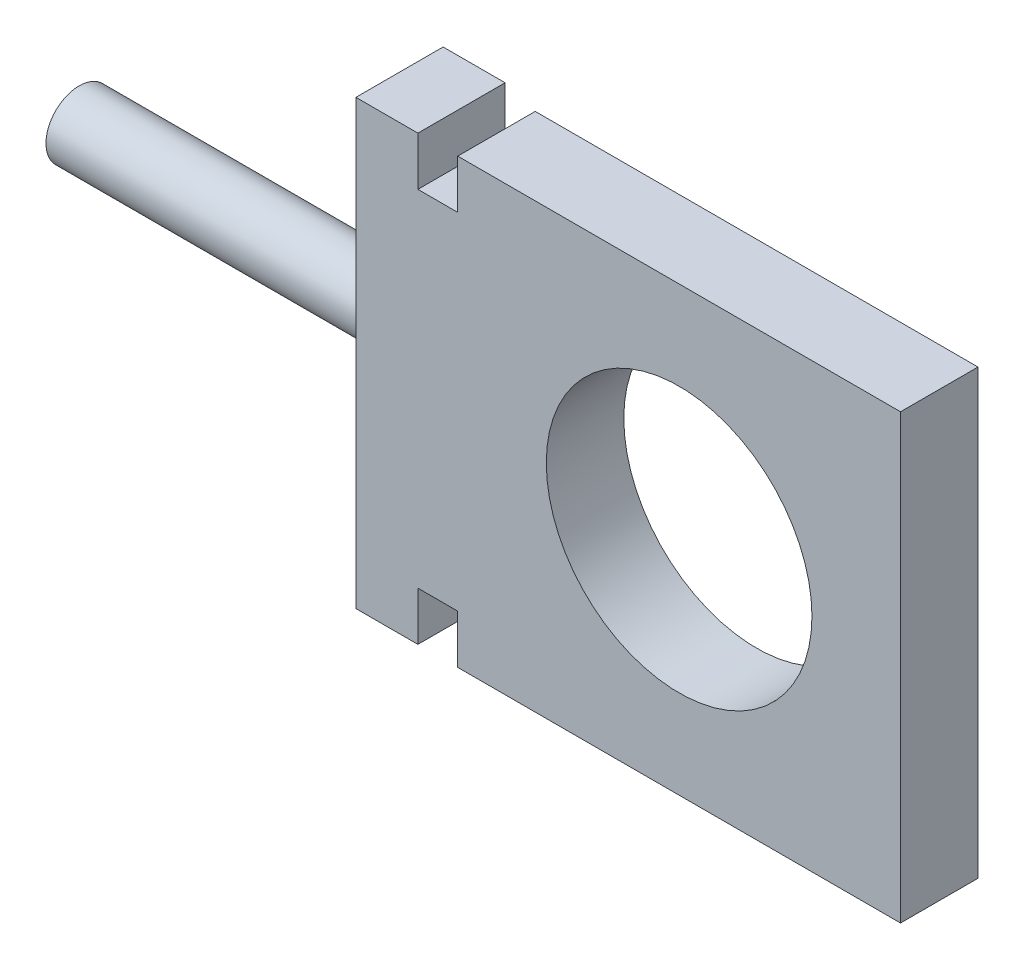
ISO-10303-21;
HEADER;
FILE_DESCRIPTION(('STEP AP214'),'2;1');
FILE_NAME('part.step','',(''),(''),'','','');
FILE_SCHEMA(('AUTOMOTIVE_DESIGN { 1 0 10303 214 1 1 1 1 }'));
ENDSEC;
DATA;
#1=APPLICATION_CONTEXT('core data for automotive mechanical design processes');
#2=APPLICATION_PROTOCOL_DEFINITION('international standard','automotive_design',2000,#1);
#3=PRODUCT_CONTEXT('',#1,'mechanical');
#4=PRODUCT('Part','Part','',(#3));
#5=PRODUCT_RELATED_PRODUCT_CATEGORY('part','',(#4));
#6=PRODUCT_DEFINITION_FORMATION('','',#4);
#7=PRODUCT_DEFINITION_CONTEXT('part definition',#1,'design');
#8=PRODUCT_DEFINITION('design','',#6,#7);
#9=PRODUCT_DEFINITION_SHAPE('','',#8);
#10=(LENGTH_UNIT() NAMED_UNIT(*) SI_UNIT(.MILLI.,.METRE.));
#11=(NAMED_UNIT(*) PLANE_ANGLE_UNIT() SI_UNIT($,.RADIAN.));
#12=(NAMED_UNIT(*) SI_UNIT($,.STERADIAN.) SOLID_ANGLE_UNIT());
#13=UNCERTAINTY_MEASURE_WITH_UNIT(LENGTH_MEASURE(1.E-05),#10,'distance_accuracy_value','');
#14=(GEOMETRIC_REPRESENTATION_CONTEXT(3) GLOBAL_UNCERTAINTY_ASSIGNED_CONTEXT((#13)) GLOBAL_UNIT_ASSIGNED_CONTEXT((#10,
#11,#12)) REPRESENTATION_CONTEXT('',''));
#15=CARTESIAN_POINT('',(0.,0.,0.));
#16=DIRECTION('',(0.,0.,1.));
#17=DIRECTION('',(1.,0.,0.));
#18=AXIS2_PLACEMENT_3D('',#15,#16,#17);
#19=CARTESIAN_POINT('',(63.5,63.5,22.225));
#20=DIRECTION('',(-1.,0.,0.));
#21=DIRECTION('',(0.,-1.,0.));
#22=AXIS2_PLACEMENT_3D('',#19,#20,#21);
#23=PLANE('',#22);
#24=DIRECTION('',(0.,1.,0.));
#25=VECTOR('',#24,1.);
#26=CARTESIAN_POINT('',(63.5,63.5,0.));
#27=LINE('',#26,#25);
#28=CARTESIAN_POINT('',(63.5,-63.5,0.));
#29=VERTEX_POINT('',#28);
#30=CARTESIAN_POINT('',(63.5,63.5,0.));
#31=VERTEX_POINT('',#30);
#32=EDGE_CURVE('E254',#29,#31,#27,.T.);
#33=ORIENTED_EDGE('',*,*,#32,.T.);
#34=DIRECTION('',(0.,0.,-1.));
#35=VECTOR('',#34,1.);
#36=CARTESIAN_POINT('',(63.5,63.5,22.225));
#37=LINE('',#36,#35);
#38=CARTESIAN_POINT('',(63.5,63.5,22.225));
#39=VERTEX_POINT('',#38);
#40=EDGE_CURVE('E42',#39,#31,#37,.T.);
#41=ORIENTED_EDGE('',*,*,#40,.F.);
#42=DIRECTION('',(0.,1.,0.));
#43=VECTOR('',#42,1.);
#44=CARTESIAN_POINT('',(63.5,63.5,22.225));
#45=LINE('',#44,#43);
#46=CARTESIAN_POINT('',(63.5,-63.5,22.225));
#47=VERTEX_POINT('',#46);
#48=EDGE_CURVE('E257',#47,#39,#45,.T.);
#49=ORIENTED_EDGE('',*,*,#48,.F.);
#50=DIRECTION('',(0.,0.,-1.));
#51=VECTOR('',#50,1.);
#52=CARTESIAN_POINT('',(63.5,-63.5,22.225));
#53=LINE('',#52,#51);
#54=EDGE_CURVE('E276',#47,#29,#53,.T.);
#55=ORIENTED_EDGE('',*,*,#54,.T.);
#56=EDGE_LOOP('',(#33,#41,#49,#55));
#57=FACE_BOUND('',#56,.T.);
#58=ADVANCED_FACE('F33',(#57),#23,.F.);
#59=CARTESIAN_POINT('',(-63.5,63.5,22.225));
#60=DIRECTION('',(0.,-1.,0.));
#61=DIRECTION('',(0.,0.,-1.));
#62=AXIS2_PLACEMENT_3D('',#59,#60,#61);
#63=PLANE('',#62);
#64=DIRECTION('',(-1.,0.,0.));
#65=VECTOR('',#64,1.);
#66=CARTESIAN_POINT('',(-63.5,63.5,0.));
#67=LINE('',#66,#65);
#68=CARTESIAN_POINT('',(-63.5,63.5,0.));
#69=VERTEX_POINT('',#68);
#70=EDGE_CURVE('E282',#31,#69,#67,.T.);
#71=ORIENTED_EDGE('',*,*,#70,.T.);
#72=DIRECTION('',(0.,0.,-1.));
#73=VECTOR('',#72,1.);
#74=CARTESIAN_POINT('',(-63.5,63.5,22.225));
#75=LINE('',#74,#73);
#76=CARTESIAN_POINT('',(-63.5,63.5,22.225));
#77=VERTEX_POINT('',#76);
#78=EDGE_CURVE('E270',#77,#69,#75,.T.);
#79=ORIENTED_EDGE('',*,*,#78,.F.);
#80=DIRECTION('',(-1.,0.,0.));
#81=VECTOR('',#80,1.);
#82=CARTESIAN_POINT('',(-63.5,63.5,22.225));
#83=LINE('',#82,#81);
#84=EDGE_CURVE('E259',#39,#77,#83,.T.);
#85=ORIENTED_EDGE('',*,*,#84,.F.);
#86=ORIENTED_EDGE('',*,*,#40,.T.);
#87=EDGE_LOOP('',(#71,#79,#85,#86));
#88=FACE_BOUND('',#87,.T.);
#89=ADVANCED_FACE('F295',(#88),#63,.F.);
#90=CARTESIAN_POINT('',(-63.5,63.5,22.225));
#91=DIRECTION('',(1.,0.,0.));
#92=DIRECTION('',(0.,0.,-1.));
#93=AXIS2_PLACEMENT_3D('',#90,#91,#92);
#94=PLANE('',#93);
#95=DIRECTION('',(0.,-1.,0.));
#96=VECTOR('',#95,1.);
#97=CARTESIAN_POINT('',(-63.5,63.5,22.225));
#98=LINE('',#97,#96);
#99=CARTESIAN_POINT('',(-63.5,-49.53,22.225));
#100=VERTEX_POINT('',#99);
#101=CARTESIAN_POINT('',(-63.5,-63.5,22.225));
#102=VERTEX_POINT('',#101);
#103=EDGE_CURVE('E227',#100,#102,#98,.T.);
#104=ORIENTED_EDGE('',*,*,#103,.F.);
#105=DIRECTION('',(0.,0.,-1.));
#106=VECTOR('',#105,1.);
#107=CARTESIAN_POINT('',(-63.5,-49.53,22.225));
#108=LINE('',#107,#106);
#109=CARTESIAN_POINT('',(-63.5,-49.53,9.525));
#110=VERTEX_POINT('',#109);
#111=EDGE_CURVE('E179',#100,#110,#108,.T.);
#112=ORIENTED_EDGE('',*,*,#111,.T.);
#113=DIRECTION('',(0.,1.,0.));
#114=VECTOR('',#113,1.);
#115=CARTESIAN_POINT('',(-63.5,49.53,9.525));
#116=LINE('',#115,#114);
#117=CARTESIAN_POINT('',(-63.5,49.53,9.525));
#118=VERTEX_POINT('',#117);
#119=EDGE_CURVE('E220',#110,#118,#116,.T.);
#120=ORIENTED_EDGE('',*,*,#119,.T.);
#121=DIRECTION('',(0.,0.,1.));
#122=VECTOR('',#121,1.);
#123=CARTESIAN_POINT('',(-63.5,49.53,22.225));
#124=LINE('',#123,#122);
#125=CARTESIAN_POINT('',(-63.5,49.53,22.225));
#126=VERTEX_POINT('',#125);
#127=EDGE_CURVE('E209',#118,#126,#124,.T.);
#128=ORIENTED_EDGE('',*,*,#127,.T.);
#129=EDGE_CURVE('E266',#77,#126,#98,.T.);
#130=ORIENTED_EDGE('',*,*,#129,.F.);
#131=ORIENTED_EDGE('',*,*,#78,.T.);
#132=DIRECTION('',(0.,-1.,0.));
#133=VECTOR('',#132,1.);
#134=CARTESIAN_POINT('',(-63.5,63.5,0.));
#135=LINE('',#134,#133);
#136=CARTESIAN_POINT('',(-63.5,-63.5,0.));
#137=VERTEX_POINT('',#136);
#138=EDGE_CURVE('E280',#69,#137,#135,.T.);
#139=ORIENTED_EDGE('',*,*,#138,.T.);
#140=DIRECTION('',(0.,0.,-1.));
#141=VECTOR('',#140,1.);
#142=CARTESIAN_POINT('',(-63.5,-63.5,22.225));
#143=LINE('',#142,#141);
#144=EDGE_CURVE('E273',#102,#137,#143,.T.);
#145=ORIENTED_EDGE('',*,*,#144,.F.);
#146=EDGE_LOOP('',(#104,#112,#120,#128,#130,#131,#139,#145));
#147=FACE_BOUND('',#146,.T.);
#148=ADVANCED_FACE('F245',(#147),#94,.F.);
#149=CARTESIAN_POINT('',(-63.5,-63.5,22.225));
#150=DIRECTION('',(0.,1.,0.));
#151=DIRECTION('',(0.,0.,1.));
#152=AXIS2_PLACEMENT_3D('',#149,#150,#151);
#153=PLANE('',#152);
#154=DIRECTION('',(1.,0.,0.));
#155=VECTOR('',#154,1.);
#156=CARTESIAN_POINT('',(-63.5,-63.5,0.));
#157=LINE('',#156,#155);
#158=EDGE_CURVE('E260',#137,#29,#157,.T.);
#159=ORIENTED_EDGE('',*,*,#158,.T.);
#160=ORIENTED_EDGE('',*,*,#54,.F.);
#161=DIRECTION('',(1.,0.,0.));
#162=VECTOR('',#161,1.);
#163=CARTESIAN_POINT('',(-63.5,-63.5,22.225));
#164=LINE('',#163,#162);
#165=EDGE_CURVE('E263',#102,#47,#164,.T.);
#166=ORIENTED_EDGE('',*,*,#165,.F.);
#167=ORIENTED_EDGE('',*,*,#144,.T.);
#168=EDGE_LOOP('',(#159,#160,#166,#167));
#169=FACE_BOUND('',#168,.T.);
#170=ADVANCED_FACE('F299',(#169),#153,.F.);
#171=CARTESIAN_POINT('',(0.,0.,22.225));
#172=DIRECTION('',(0.,0.,1.));
#173=DIRECTION('',(1.,0.,0.));
#174=AXIS2_PLACEMENT_3D('',#171,#172,#173);
#175=PLANE('',#174);
#176=CARTESIAN_POINT('',(0.,0.,22.225));
#177=DIRECTION('',(0.,0.,1.));
#178=DIRECTION('',(1.,0.,0.));
#179=AXIS2_PLACEMENT_3D('',#176,#177,#178);
#180=CIRCLE('',#179,38.1);
#181=CARTESIAN_POINT('',(38.1,0.,22.225));
#182=VERTEX_POINT('',#181);
#183=EDGE_CURVE('E235',#182,#182,#180,.T.);
#184=ORIENTED_EDGE('',*,*,#183,.F.);
#185=EDGE_LOOP('',(#184));
#186=FACE_BOUND('',#185,.T.);
#187=ORIENTED_EDGE('',*,*,#48,.T.);
#188=ORIENTED_EDGE('',*,*,#84,.T.);
#189=ORIENTED_EDGE('',*,*,#129,.T.);
#190=DIRECTION('',(1.,0.,0.));
#191=VECTOR('',#190,1.);
#192=CARTESIAN_POINT('',(-74.93,49.53,22.225));
#193=LINE('',#192,#191);
#194=CARTESIAN_POINT('',(-74.93,49.53,22.225));
#195=VERTEX_POINT('',#194);
#196=EDGE_CURVE('E57',#195,#126,#193,.T.);
#197=ORIENTED_EDGE('',*,*,#196,.F.);
#198=DIRECTION('',(0.,1.,0.));
#199=VECTOR('',#198,1.);
#200=CARTESIAN_POINT('',(-74.93,-63.5,22.225));
#201=LINE('',#200,#199);
#202=CARTESIAN_POINT('',(-74.93,63.5,22.225));
#203=VERTEX_POINT('',#202);
#204=EDGE_CURVE('E164',#195,#203,#201,.T.);
#205=ORIENTED_EDGE('',*,*,#204,.T.);
#206=DIRECTION('',(1.,0.,0.));
#207=VECTOR('',#206,1.);
#208=CARTESIAN_POINT('',(-92.71,63.5,22.225));
#209=LINE('',#208,#207);
#210=CARTESIAN_POINT('',(-92.71,63.5,22.225));
#211=VERTEX_POINT('',#210);
#212=EDGE_CURVE('E180',#211,#203,#209,.T.);
#213=ORIENTED_EDGE('',*,*,#212,.F.);
#214=DIRECTION('',(0.,1.,0.));
#215=VECTOR('',#214,1.);
#216=CARTESIAN_POINT('',(-92.71,-63.5,22.225));
#217=LINE('',#216,#215);
#218=CARTESIAN_POINT('',(-92.71,-63.5,22.225));
#219=VERTEX_POINT('',#218);
#220=EDGE_CURVE('E158',#219,#211,#217,.T.);
#221=ORIENTED_EDGE('',*,*,#220,.F.);
#222=DIRECTION('',(1.,0.,0.));
#223=VECTOR('',#222,1.);
#224=CARTESIAN_POINT('',(-92.71,-63.5,22.225));
#225=LINE('',#224,#223);
#226=CARTESIAN_POINT('',(-74.93,-63.5,22.225));
#227=VERTEX_POINT('',#226);
#228=EDGE_CURVE('E176',#219,#227,#225,.T.);
#229=ORIENTED_EDGE('',*,*,#228,.T.);
#230=CARTESIAN_POINT('',(-74.93,-49.53,22.225));
#231=VERTEX_POINT('',#230);
#232=EDGE_CURVE('E173',#227,#231,#201,.T.);
#233=ORIENTED_EDGE('',*,*,#232,.T.);
#234=DIRECTION('',(1.,0.,0.));
#235=VECTOR('',#234,1.);
#236=CARTESIAN_POINT('',(-74.93,-49.53,22.225));
#237=LINE('',#236,#235);
#238=EDGE_CURVE('E231',#231,#100,#237,.T.);
#239=ORIENTED_EDGE('',*,*,#238,.T.);
#240=ORIENTED_EDGE('',*,*,#103,.T.);
#241=ORIENTED_EDGE('',*,*,#165,.T.);
#242=EDGE_LOOP('',(#187,#188,#189,#197,#205,#213,#221,#229,#233,#239,#240,#241));
#243=FACE_BOUND('',#242,.T.);
#244=ADVANCED_FACE('F200',(#186,#243),#175,.T.);
#245=CARTESIAN_POINT('',(0.,0.,0.));
#246=DIRECTION('',(0.,0.,1.));
#247=DIRECTION('',(1.,0.,0.));
#248=AXIS2_PLACEMENT_3D('',#245,#246,#247);
#249=PLANE('',#248);
#250=CARTESIAN_POINT('',(0.,0.,0.));
#251=DIRECTION('',(0.,0.,1.));
#252=DIRECTION('',(1.,0.,0.));
#253=AXIS2_PLACEMENT_3D('',#250,#251,#252);
#254=CIRCLE('',#253,38.1);
#255=CARTESIAN_POINT('',(38.1,0.,0.));
#256=VERTEX_POINT('',#255);
#257=EDGE_CURVE('E251',#256,#256,#254,.T.);
#258=ORIENTED_EDGE('',*,*,#257,.T.);
#259=EDGE_LOOP('',(#258));
#260=FACE_BOUND('',#259,.T.);
#261=ORIENTED_EDGE('',*,*,#32,.F.);
#262=ORIENTED_EDGE('',*,*,#158,.F.);
#263=ORIENTED_EDGE('',*,*,#138,.F.);
#264=ORIENTED_EDGE('',*,*,#70,.F.);
#265=EDGE_LOOP('',(#261,#262,#263,#264));
#266=FACE_BOUND('',#265,.T.);
#267=ADVANCED_FACE('F291',(#260,#266),#249,.F.);
#268=CARTESIAN_POINT('',(0.,0.,0.));
#269=DIRECTION('',(0.,0.,1.));
#270=DIRECTION('',(1.,0.,0.));
#271=AXIS2_PLACEMENT_3D('',#268,#269,#270);
#272=CYLINDRICAL_SURFACE('',#271,38.1);
#273=ORIENTED_EDGE('',*,*,#257,.F.);
#274=EDGE_LOOP('',(#273));
#275=FACE_BOUND('',#274,.T.);
#276=ORIENTED_EDGE('',*,*,#183,.T.);
#277=EDGE_LOOP('',(#276));
#278=FACE_BOUND('',#277,.T.);
#279=ADVANCED_FACE('F328',(#275,#278),#272,.F.);
#280=CARTESIAN_POINT('',(-74.93,-49.53,22.225));
#281=DIRECTION('',(0.,-1.,0.));
#282=DIRECTION('',(0.,0.,-1.));
#283=AXIS2_PLACEMENT_3D('',#280,#281,#282);
#284=PLANE('',#283);
#285=ORIENTED_EDGE('',*,*,#111,.F.);
#286=ORIENTED_EDGE('',*,*,#238,.F.);
#287=DIRECTION('',(0.,0.,-1.));
#288=VECTOR('',#287,1.);
#289=CARTESIAN_POINT('',(-74.93,-49.53,22.225));
#290=LINE('',#289,#288);
#291=CARTESIAN_POINT('',(-74.93,-49.53,9.525));
#292=VERTEX_POINT('',#291);
#293=EDGE_CURVE('E216',#231,#292,#290,.T.);
#294=ORIENTED_EDGE('',*,*,#293,.T.);
#295=DIRECTION('',(1.,0.,0.));
#296=VECTOR('',#295,1.);
#297=CARTESIAN_POINT('',(-74.93,-49.53,9.525));
#298=LINE('',#297,#296);
#299=EDGE_CURVE('E206',#292,#110,#298,.T.);
#300=ORIENTED_EDGE('',*,*,#299,.T.);
#301=EDGE_LOOP('',(#285,#286,#294,#300));
#302=FACE_BOUND('',#301,.T.);
#303=ADVANCED_FACE('F249',(#302),#284,.T.);
#304=CARTESIAN_POINT('',(-74.93,49.53,22.225));
#305=DIRECTION('',(0.,1.,0.));
#306=DIRECTION('',(0.,0.,1.));
#307=AXIS2_PLACEMENT_3D('',#304,#305,#306);
#308=PLANE('',#307);
#309=ORIENTED_EDGE('',*,*,#127,.F.);
#310=DIRECTION('',(1.,0.,0.));
#311=VECTOR('',#310,1.);
#312=CARTESIAN_POINT('',(-74.93,49.53,9.525));
#313=LINE('',#312,#311);
#314=CARTESIAN_POINT('',(-74.93,49.53,9.525));
#315=VERTEX_POINT('',#314);
#316=EDGE_CURVE('E207',#315,#118,#313,.T.);
#317=ORIENTED_EDGE('',*,*,#316,.F.);
#318=DIRECTION('',(0.,0.,1.));
#319=VECTOR('',#318,1.);
#320=CARTESIAN_POINT('',(-74.93,49.53,22.225));
#321=LINE('',#320,#319);
#322=EDGE_CURVE('E36',#315,#195,#321,.T.);
#323=ORIENTED_EDGE('',*,*,#322,.T.);
#324=ORIENTED_EDGE('',*,*,#196,.T.);
#325=EDGE_LOOP('',(#309,#317,#323,#324));
#326=FACE_BOUND('',#325,.T.);
#327=ADVANCED_FACE('F208',(#326),#308,.T.);
#328=CARTESIAN_POINT('',(-74.93,49.53,9.525));
#329=DIRECTION('',(0.,0.,-1.));
#330=DIRECTION('',(-1.,0.,0.));
#331=AXIS2_PLACEMENT_3D('',#328,#329,#330);
#332=PLANE('',#331);
#333=ORIENTED_EDGE('',*,*,#119,.F.);
#334=ORIENTED_EDGE('',*,*,#299,.F.);
#335=DIRECTION('',(0.,1.,0.));
#336=VECTOR('',#335,1.);
#337=CARTESIAN_POINT('',(-74.93,49.53,9.525));
#338=LINE('',#337,#336);
#339=EDGE_CURVE('E204',#292,#315,#338,.T.);
#340=ORIENTED_EDGE('',*,*,#339,.T.);
#341=ORIENTED_EDGE('',*,*,#316,.T.);
#342=EDGE_LOOP('',(#333,#334,#340,#341));
#343=FACE_BOUND('',#342,.T.);
#344=ADVANCED_FACE('F214',(#343),#332,.T.);
#345=CARTESIAN_POINT('',(-92.71,-63.5,-2.794));
#346=DIRECTION('',(0.,1.,0.));
#347=DIRECTION('',(-1.,0.,0.));
#348=AXIS2_PLACEMENT_3D('',#345,#346,#347);
#349=PLANE('',#348);
#350=DIRECTION('',(0.,0.,1.));
#351=VECTOR('',#350,1.);
#352=CARTESIAN_POINT('',(-74.93,-63.5,-2.794));
#353=LINE('',#352,#351);
#354=CARTESIAN_POINT('',(-74.93,-63.5,-2.794));
#355=VERTEX_POINT('',#354);
#356=EDGE_CURVE('E152',#355,#227,#353,.T.);
#357=ORIENTED_EDGE('',*,*,#356,.T.);
#358=ORIENTED_EDGE('',*,*,#228,.F.);
#359=DIRECTION('',(0.,0.,1.));
#360=VECTOR('',#359,1.);
#361=CARTESIAN_POINT('',(-92.71,-63.5,-2.794));
#362=LINE('',#361,#360);
#363=CARTESIAN_POINT('',(-92.71,-63.5,-2.794));
#364=VERTEX_POINT('',#363);
#365=EDGE_CURVE('E155',#364,#219,#362,.T.);
#366=ORIENTED_EDGE('',*,*,#365,.F.);
#367=DIRECTION('',(1.,0.,0.));
#368=VECTOR('',#367,1.);
#369=CARTESIAN_POINT('',(-92.71,-63.5,-2.794));
#370=LINE('',#369,#368);
#371=EDGE_CURVE('E137',#364,#355,#370,.T.);
#372=ORIENTED_EDGE('',*,*,#371,.T.);
#373=EDGE_LOOP('',(#357,#358,#366,#372));
#374=FACE_BOUND('',#373,.T.);
#375=ADVANCED_FACE('F196',(#374),#349,.F.);
#376=CARTESIAN_POINT('',(-92.71,63.5,-2.794));
#377=DIRECTION('',(0.,-1.,0.));
#378=DIRECTION('',(0.,0.,-1.));
#379=AXIS2_PLACEMENT_3D('',#376,#377,#378);
#380=PLANE('',#379);
#381=DIRECTION('',(0.,0.,-1.));
#382=VECTOR('',#381,1.);
#383=CARTESIAN_POINT('',(-74.93,63.5,-2.794));
#384=LINE('',#383,#382);
#385=CARTESIAN_POINT('',(-74.93,63.5,-2.794));
#386=VERTEX_POINT('',#385);
#387=EDGE_CURVE('E167',#203,#386,#384,.T.);
#388=ORIENTED_EDGE('',*,*,#387,.T.);
#389=DIRECTION('',(1.,0.,0.));
#390=VECTOR('',#389,1.);
#391=CARTESIAN_POINT('',(-92.71,63.5,-2.794));
#392=LINE('',#391,#390);
#393=CARTESIAN_POINT('',(-92.71,63.5,-2.794));
#394=VERTEX_POINT('',#393);
#395=EDGE_CURVE('E183',#394,#386,#392,.T.);
#396=ORIENTED_EDGE('',*,*,#395,.F.);
#397=DIRECTION('',(0.,0.,-1.));
#398=VECTOR('',#397,1.);
#399=CARTESIAN_POINT('',(-92.71,63.5,-2.794));
#400=LINE('',#399,#398);
#401=EDGE_CURVE('E133',#211,#394,#400,.T.);
#402=ORIENTED_EDGE('',*,*,#401,.F.);
#403=ORIENTED_EDGE('',*,*,#212,.T.);
#404=EDGE_LOOP('',(#388,#396,#402,#403));
#405=FACE_BOUND('',#404,.T.);
#406=ADVANCED_FACE('F189',(#405),#380,.F.);
#407=CARTESIAN_POINT('',(-92.71,-63.5,-2.794));
#408=DIRECTION('',(0.,0.,1.));
#409=DIRECTION('',(1.,0.,0.));
#410=AXIS2_PLACEMENT_3D('',#407,#408,#409);
#411=PLANE('',#410);
#412=DIRECTION('',(0.,-1.,0.));
#413=VECTOR('',#412,1.);
#414=CARTESIAN_POINT('',(-74.93,-63.5,-2.794));
#415=LINE('',#414,#413);
#416=EDGE_CURVE('E159',#386,#355,#415,.T.);
#417=ORIENTED_EDGE('',*,*,#416,.T.);
#418=ORIENTED_EDGE('',*,*,#371,.F.);
#419=DIRECTION('',(0.,-1.,0.));
#420=VECTOR('',#419,1.);
#421=CARTESIAN_POINT('',(-92.71,-63.5,-2.794));
#422=LINE('',#421,#420);
#423=CARTESIAN_POINT('',(-92.71,-5.35964075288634,-2.794));
#424=VERTEX_POINT('',#423);
#425=EDGE_CURVE('E140',#424,#364,#422,.T.);
#426=ORIENTED_EDGE('',*,*,#425,.F.);
#427=CARTESIAN_POINT('',(-92.71,5.35964075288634,-2.794));
#428=VERTEX_POINT('',#427);
#429=EDGE_CURVE('E138',#428,#424,#422,.T.);
#430=ORIENTED_EDGE('',*,*,#429,.F.);
#431=EDGE_CURVE('E129',#394,#428,#422,.T.);
#432=ORIENTED_EDGE('',*,*,#431,.F.);
#433=ORIENTED_EDGE('',*,*,#395,.T.);
#434=EDGE_LOOP('',(#417,#418,#426,#430,#432,#433));
#435=FACE_BOUND('',#434,.T.);
#436=ADVANCED_FACE('F142',(#435),#411,.F.);
#437=CARTESIAN_POINT('',(-92.71,0.,0.));
#438=DIRECTION('',(-1.,0.,0.));
#439=DIRECTION('',(0.,0.,1.));
#440=AXIS2_PLACEMENT_3D('',#437,#438,#439);
#441=PLANE('',#440);
#442=CARTESIAN_POINT('',(-92.71,0.,5.08));
#443=DIRECTION('',(-1.,0.,0.));
#444=DIRECTION('',(0.,-1.,0.));
#445=AXIS2_PLACEMENT_3D('',#442,#443,#444);
#446=CIRCLE('',#445,9.525);
#447=EDGE_CURVE('E11',#424,#428,#446,.T.);
#448=ORIENTED_EDGE('',*,*,#447,.F.);
#449=ORIENTED_EDGE('',*,*,#425,.T.);
#450=ORIENTED_EDGE('',*,*,#365,.T.);
#451=ORIENTED_EDGE('',*,*,#220,.T.);
#452=ORIENTED_EDGE('',*,*,#401,.T.);
#453=ORIENTED_EDGE('',*,*,#431,.T.);
#454=EDGE_LOOP('',(#448,#449,#450,#451,#452,#453));
#455=FACE_BOUND('',#454,.T.);
#456=ADVANCED_FACE('F131',(#455),#441,.T.);
#457=CARTESIAN_POINT('',(-74.93,0.,0.));
#458=DIRECTION('',(-1.,0.,0.));
#459=DIRECTION('',(0.,0.,1.));
#460=AXIS2_PLACEMENT_3D('',#457,#458,#459);
#461=PLANE('',#460);
#462=ORIENTED_EDGE('',*,*,#293,.F.);
#463=ORIENTED_EDGE('',*,*,#232,.F.);
#464=ORIENTED_EDGE('',*,*,#356,.F.);
#465=ORIENTED_EDGE('',*,*,#416,.F.);
#466=ORIENTED_EDGE('',*,*,#387,.F.);
#467=ORIENTED_EDGE('',*,*,#204,.F.);
#468=ORIENTED_EDGE('',*,*,#322,.F.);
#469=ORIENTED_EDGE('',*,*,#339,.F.);
#470=EDGE_LOOP('',(#462,#463,#464,#465,#466,#467,#468,#469));
#471=FACE_BOUND('',#470,.T.);
#472=ADVANCED_FACE('F193',(#471),#461,.F.);
#473=CARTESIAN_POINT('',(-92.71,0.,5.08));
#474=DIRECTION('',(-1.,0.,0.));
#475=DIRECTION('',(0.,-1.,0.));
#476=AXIS2_PLACEMENT_3D('',#473,#474,#475);
#477=PLANE('',#476);
#478=EDGE_CURVE('E44',#428,#424,#446,.T.);
#479=ORIENTED_EDGE('',*,*,#478,.F.);
#480=ORIENTED_EDGE('',*,*,#429,.T.);
#481=EDGE_LOOP('',(#479,#480));
#482=FACE_BOUND('',#481,.T.);
#483=ADVANCED_FACE('F149',(#482),#477,.F.);
#484=CARTESIAN_POINT('',(-189.23,0.,5.08));
#485=DIRECTION('',(1.,0.,0.));
#486=DIRECTION('',(0.,1.,0.));
#487=AXIS2_PLACEMENT_3D('',#484,#485,#486);
#488=CYLINDRICAL_SURFACE('',#487,9.525);
#489=CARTESIAN_POINT('',(-189.23,0.,5.08));
#490=DIRECTION('',(-1.,0.,0.));
#491=DIRECTION('',(0.,-1.,0.));
#492=AXIS2_PLACEMENT_3D('',#489,#490,#491);
#493=CIRCLE('',#492,9.525);
#494=CARTESIAN_POINT('',(-189.23,-9.525,5.08));
#495=VERTEX_POINT('',#494);
#496=EDGE_CURVE('E150',#495,#495,#493,.T.);
#497=ORIENTED_EDGE('',*,*,#496,.F.);
#498=EDGE_LOOP('',(#497));
#499=FACE_BOUND('',#498,.T.);
#500=ORIENTED_EDGE('',*,*,#478,.T.);
#501=ORIENTED_EDGE('',*,*,#447,.T.);
#502=EDGE_LOOP('',(#500,#501));
#503=FACE_BOUND('',#502,.T.);
#504=ADVANCED_FACE('F148',(#499,#503),#488,.T.);
#505=CARTESIAN_POINT('',(-189.23,0.,5.08));
#506=DIRECTION('',(-1.,0.,0.));
#507=DIRECTION('',(0.,-1.,0.));
#508=AXIS2_PLACEMENT_3D('',#505,#506,#507);
#509=PLANE('',#508);
#510=ORIENTED_EDGE('',*,*,#496,.T.);
#511=EDGE_LOOP('',(#510));
#512=FACE_BOUND('',#511,.T.);
#513=ADVANCED_FACE('F416',(#512),#509,.T.);
#514=CLOSED_SHELL('',(#58,#89,#148,#170,#244,#267,#279,#303,#327,#344,#375,#406,#436,#456,#472,
#483,#504,#513));
#515=MANIFOLD_SOLID_BREP('B2',#514);
#516=ADVANCED_BREP_SHAPE_REPRESENTATION('',(#18,#515),#14);
#517=SHAPE_DEFINITION_REPRESENTATION(#9,#516);
ENDSEC;
END-ISO-10303-21;
